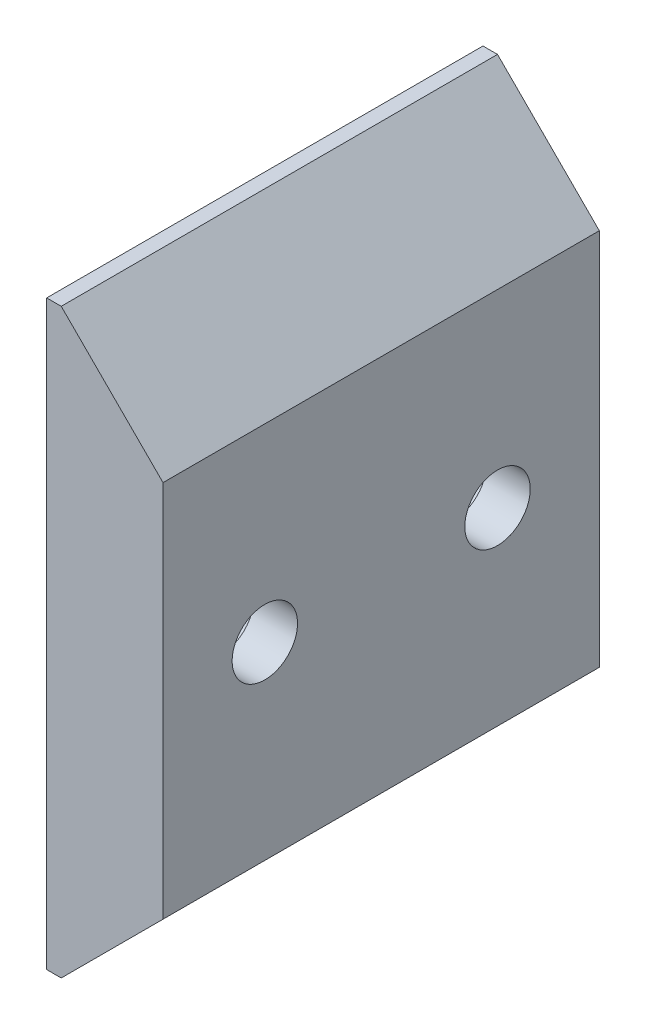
ISO-10303-21;
HEADER;
FILE_DESCRIPTION(('STEP AP214'),'2;1');
FILE_NAME('part.step','',(''),(''),'','','');
FILE_SCHEMA(('AUTOMOTIVE_DESIGN { 1 0 10303 214 1 1 1 1 }'));
ENDSEC;
DATA;
#1=APPLICATION_CONTEXT('core data for automotive mechanical design processes');
#2=APPLICATION_PROTOCOL_DEFINITION('international standard','automotive_design',2000,#1);
#3=PRODUCT_CONTEXT('',#1,'mechanical');
#4=PRODUCT('Part','Part','',(#3));
#5=PRODUCT_RELATED_PRODUCT_CATEGORY('part','',(#4));
#6=PRODUCT_DEFINITION_FORMATION('','',#4);
#7=PRODUCT_DEFINITION_CONTEXT('part definition',#1,'design');
#8=PRODUCT_DEFINITION('design','',#6,#7);
#9=PRODUCT_DEFINITION_SHAPE('','',#8);
#10=(LENGTH_UNIT() NAMED_UNIT(*) SI_UNIT(.MILLI.,.METRE.));
#11=(NAMED_UNIT(*) PLANE_ANGLE_UNIT() SI_UNIT($,.RADIAN.));
#12=(NAMED_UNIT(*) SI_UNIT($,.STERADIAN.) SOLID_ANGLE_UNIT());
#13=UNCERTAINTY_MEASURE_WITH_UNIT(LENGTH_MEASURE(1.E-05),#10,'distance_accuracy_value','');
#14=(GEOMETRIC_REPRESENTATION_CONTEXT(3) GLOBAL_UNCERTAINTY_ASSIGNED_CONTEXT((#13)) GLOBAL_UNIT_ASSIGNED_CONTEXT((#10,
#11,#12)) REPRESENTATION_CONTEXT('',''));
#15=CARTESIAN_POINT('',(0.,0.,0.));
#16=DIRECTION('',(0.,0.,1.));
#17=DIRECTION('',(1.,0.,0.));
#18=AXIS2_PLACEMENT_3D('',#15,#16,#17);
#19=CARTESIAN_POINT('',(0.,20.,15.));
#20=DIRECTION('',(0.,-1.,0.));
#21=DIRECTION('',(0.,0.,-1.));
#22=AXIS2_PLACEMENT_3D('',#19,#20,#21);
#23=PLANE('',#22);
#24=DIRECTION('',(-1.,0.,0.));
#25=VECTOR('',#24,1.);
#26=CARTESIAN_POINT('',(0.,20.,-15.));
#27=LINE('',#26,#25);
#28=CARTESIAN_POINT('',(1.,20.,-15.));
#29=VERTEX_POINT('',#28);
#30=CARTESIAN_POINT('',(0.,20.,-15.));
#31=VERTEX_POINT('',#30);
#32=EDGE_CURVE('E84',#29,#31,#27,.T.);
#33=ORIENTED_EDGE('',*,*,#32,.T.);
#34=DIRECTION('',(0.,0.,-1.));
#35=VECTOR('',#34,1.);
#36=CARTESIAN_POINT('',(0.,20.,15.));
#37=LINE('',#36,#35);
#38=CARTESIAN_POINT('',(0.,20.,15.));
#39=VERTEX_POINT('',#38);
#40=EDGE_CURVE('E11',#39,#31,#37,.T.);
#41=ORIENTED_EDGE('',*,*,#40,.F.);
#42=DIRECTION('',(-1.,0.,0.));
#43=VECTOR('',#42,1.);
#44=CARTESIAN_POINT('',(0.,20.,15.));
#45=LINE('',#44,#43);
#46=CARTESIAN_POINT('',(1.,20.,15.));
#47=VERTEX_POINT('',#46);
#48=EDGE_CURVE('E112',#47,#39,#45,.T.);
#49=ORIENTED_EDGE('',*,*,#48,.F.);
#50=DIRECTION('',(0.,0.,-1.));
#51=VECTOR('',#50,1.);
#52=CARTESIAN_POINT('',(1.,20.,15.));
#53=LINE('',#52,#51);
#54=EDGE_CURVE('E97',#47,#29,#53,.T.);
#55=ORIENTED_EDGE('',*,*,#54,.T.);
#56=EDGE_LOOP('',(#33,#41,#49,#55));
#57=FACE_BOUND('',#56,.T.);
#58=ADVANCED_FACE('F28',(#57),#23,.F.);
#59=CARTESIAN_POINT('',(0.,-20.,15.));
#60=DIRECTION('',(1.,0.,0.));
#61=DIRECTION('',(0.,0.,-1.));
#62=AXIS2_PLACEMENT_3D('',#59,#60,#61);
#63=PLANE('',#62);
#64=CARTESIAN_POINT('',(0.,0.,8.));
#65=DIRECTION('',(-1.,0.,0.));
#66=DIRECTION('',(0.,0.,1.));
#67=AXIS2_PLACEMENT_3D('',#64,#65,#66);
#68=CIRCLE('',#67,4.);
#69=CARTESIAN_POINT('',(0.,0.,12.));
#70=VERTEX_POINT('',#69);
#71=EDGE_CURVE('E268',#70,#70,#68,.T.);
#72=ORIENTED_EDGE('',*,*,#71,.F.);
#73=EDGE_LOOP('',(#72));
#74=FACE_BOUND('',#73,.T.);
#75=CARTESIAN_POINT('',(0.,0.,-8.));
#76=DIRECTION('',(-1.,0.,0.));
#77=DIRECTION('',(0.,0.,1.));
#78=AXIS2_PLACEMENT_3D('',#75,#76,#77);
#79=CIRCLE('',#78,4.);
#80=CARTESIAN_POINT('',(0.,0.,-4.));
#81=VERTEX_POINT('',#80);
#82=EDGE_CURVE('E98',#81,#81,#79,.T.);
#83=ORIENTED_EDGE('',*,*,#82,.F.);
#84=EDGE_LOOP('',(#83));
#85=FACE_BOUND('',#84,.T.);
#86=DIRECTION('',(0.,-1.,0.));
#87=VECTOR('',#86,1.);
#88=CARTESIAN_POINT('',(0.,-20.,-15.));
#89=LINE('',#88,#87);
#90=CARTESIAN_POINT('',(0.,-20.,-15.));
#91=VERTEX_POINT('',#90);
#92=EDGE_CURVE('E80',#31,#91,#89,.T.);
#93=ORIENTED_EDGE('',*,*,#92,.T.);
#94=DIRECTION('',(0.,0.,-1.));
#95=VECTOR('',#94,1.);
#96=CARTESIAN_POINT('',(0.,-20.,15.));
#97=LINE('',#96,#95);
#98=CARTESIAN_POINT('',(0.,-20.,15.));
#99=VERTEX_POINT('',#98);
#100=EDGE_CURVE('E35',#99,#91,#97,.T.);
#101=ORIENTED_EDGE('',*,*,#100,.F.);
#102=DIRECTION('',(0.,-1.,0.));
#103=VECTOR('',#102,1.);
#104=CARTESIAN_POINT('',(0.,-20.,15.));
#105=LINE('',#104,#103);
#106=EDGE_CURVE('E93',#39,#99,#105,.T.);
#107=ORIENTED_EDGE('',*,*,#106,.F.);
#108=ORIENTED_EDGE('',*,*,#40,.T.);
#109=EDGE_LOOP('',(#93,#101,#107,#108));
#110=FACE_BOUND('',#109,.T.);
#111=ADVANCED_FACE('F92',(#74,#85,#110),#63,.F.);
#112=CARTESIAN_POINT('',(0.,-20.,15.));
#113=DIRECTION('',(0.,1.,0.));
#114=DIRECTION('',(0.,0.,1.));
#115=AXIS2_PLACEMENT_3D('',#112,#113,#114);
#116=PLANE('',#115);
#117=DIRECTION('',(1.,0.,0.));
#118=VECTOR('',#117,1.);
#119=CARTESIAN_POINT('',(0.,-20.,-15.));
#120=LINE('',#119,#118);
#121=CARTESIAN_POINT('',(1.,-20.,-15.));
#122=VERTEX_POINT('',#121);
#123=EDGE_CURVE('E86',#91,#122,#120,.T.);
#124=ORIENTED_EDGE('',*,*,#123,.T.);
#125=DIRECTION('',(0.,0.,-1.));
#126=VECTOR('',#125,1.);
#127=CARTESIAN_POINT('',(1.,-20.,15.));
#128=LINE('',#127,#126);
#129=CARTESIAN_POINT('',(1.,-20.,15.));
#130=VERTEX_POINT('',#129);
#131=EDGE_CURVE('E128',#130,#122,#128,.T.);
#132=ORIENTED_EDGE('',*,*,#131,.F.);
#133=DIRECTION('',(1.,0.,0.));
#134=VECTOR('',#133,1.);
#135=CARTESIAN_POINT('',(0.,-20.,15.));
#136=LINE('',#135,#134);
#137=EDGE_CURVE('E115',#99,#130,#136,.T.);
#138=ORIENTED_EDGE('',*,*,#137,.F.);
#139=ORIENTED_EDGE('',*,*,#100,.T.);
#140=EDGE_LOOP('',(#124,#132,#138,#139));
#141=FACE_BOUND('',#140,.T.);
#142=ADVANCED_FACE('F132',(#141),#116,.F.);
#143=CARTESIAN_POINT('',(1.,-20.,15.));
#144=DIRECTION('',(-0.707106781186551,0.707106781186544,0.));
#145=DIRECTION('',(-0.707106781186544,-0.707106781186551,0.));
#146=AXIS2_PLACEMENT_3D('',#143,#144,#145);
#147=PLANE('',#146);
#148=DIRECTION('',(0.707106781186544,0.707106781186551,0.));
#149=VECTOR('',#148,1.);
#150=CARTESIAN_POINT('',(1.,-20.,-15.));
#151=LINE('',#150,#149);
#152=CARTESIAN_POINT('',(8.,-12.9999999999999,-15.));
#153=VERTEX_POINT('',#152);
#154=EDGE_CURVE('E106',#122,#153,#151,.T.);
#155=ORIENTED_EDGE('',*,*,#154,.T.);
#156=DIRECTION('',(0.,0.,-1.));
#157=VECTOR('',#156,1.);
#158=CARTESIAN_POINT('',(8.,-12.9999999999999,15.));
#159=LINE('',#158,#157);
#160=CARTESIAN_POINT('',(8.,-12.9999999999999,15.));
#161=VERTEX_POINT('',#160);
#162=EDGE_CURVE('E125',#161,#153,#159,.T.);
#163=ORIENTED_EDGE('',*,*,#162,.F.);
#164=DIRECTION('',(0.707106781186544,0.707106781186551,0.));
#165=VECTOR('',#164,1.);
#166=CARTESIAN_POINT('',(1.,-20.,15.));
#167=LINE('',#166,#165);
#168=EDGE_CURVE('E117',#130,#161,#167,.T.);
#169=ORIENTED_EDGE('',*,*,#168,.F.);
#170=ORIENTED_EDGE('',*,*,#131,.T.);
#171=EDGE_LOOP('',(#155,#163,#169,#170));
#172=FACE_BOUND('',#171,.T.);
#173=ADVANCED_FACE('F138',(#172),#147,.F.);
#174=CARTESIAN_POINT('',(8.,12.9999999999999,15.));
#175=DIRECTION('',(-1.,0.,0.));
#176=DIRECTION('',(0.,0.,1.));
#177=AXIS2_PLACEMENT_3D('',#174,#175,#176);
#178=PLANE('',#177);
#179=CARTESIAN_POINT('',(8.,0.,8.));
#180=DIRECTION('',(-1.,0.,0.));
#181=DIRECTION('',(0.,0.,1.));
#182=AXIS2_PLACEMENT_3D('',#179,#180,#181);
#183=CIRCLE('',#182,2.25);
#184=CARTESIAN_POINT('',(8.,0.,10.25));
#185=VERTEX_POINT('',#184);
#186=EDGE_CURVE('E261',#185,#185,#183,.T.);
#187=ORIENTED_EDGE('',*,*,#186,.T.);
#188=EDGE_LOOP('',(#187));
#189=FACE_BOUND('',#188,.T.);
#190=CARTESIAN_POINT('',(8.,0.,-8.));
#191=DIRECTION('',(-1.,0.,0.));
#192=DIRECTION('',(0.,0.,1.));
#193=AXIS2_PLACEMENT_3D('',#190,#191,#192);
#194=CIRCLE('',#193,2.25);
#195=CARTESIAN_POINT('',(8.,0.,-5.75));
#196=VERTEX_POINT('',#195);
#197=EDGE_CURVE('E274',#196,#196,#194,.T.);
#198=ORIENTED_EDGE('',*,*,#197,.T.);
#199=EDGE_LOOP('',(#198));
#200=FACE_BOUND('',#199,.T.);
#201=DIRECTION('',(0.,1.,0.));
#202=VECTOR('',#201,1.);
#203=CARTESIAN_POINT('',(8.,12.9999999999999,-15.));
#204=LINE('',#203,#202);
#205=CARTESIAN_POINT('',(8.,12.9999999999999,-15.));
#206=VERTEX_POINT('',#205);
#207=EDGE_CURVE('E108',#153,#206,#204,.T.);
#208=ORIENTED_EDGE('',*,*,#207,.T.);
#209=DIRECTION('',(0.,0.,-1.));
#210=VECTOR('',#209,1.);
#211=CARTESIAN_POINT('',(8.,12.9999999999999,15.));
#212=LINE('',#211,#210);
#213=CARTESIAN_POINT('',(8.,12.9999999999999,15.));
#214=VERTEX_POINT('',#213);
#215=EDGE_CURVE('E122',#214,#206,#212,.T.);
#216=ORIENTED_EDGE('',*,*,#215,.F.);
#217=DIRECTION('',(0.,1.,0.));
#218=VECTOR('',#217,1.);
#219=CARTESIAN_POINT('',(8.,12.9999999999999,15.));
#220=LINE('',#219,#218);
#221=EDGE_CURVE('E47',#161,#214,#220,.T.);
#222=ORIENTED_EDGE('',*,*,#221,.F.);
#223=ORIENTED_EDGE('',*,*,#162,.T.);
#224=EDGE_LOOP('',(#208,#216,#222,#223));
#225=FACE_BOUND('',#224,.T.);
#226=ADVANCED_FACE('F141',(#189,#200,#225),#178,.F.);
#227=CARTESIAN_POINT('',(1.,20.,15.));
#228=DIRECTION('',(-0.707106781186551,-0.707106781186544,0.));
#229=DIRECTION('',(0.707106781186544,-0.707106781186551,0.));
#230=AXIS2_PLACEMENT_3D('',#227,#228,#229);
#231=PLANE('',#230);
#232=DIRECTION('',(-0.707106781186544,0.707106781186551,0.));
#233=VECTOR('',#232,1.);
#234=CARTESIAN_POINT('',(1.,20.,-15.));
#235=LINE('',#234,#233);
#236=EDGE_CURVE('E110',#206,#29,#235,.T.);
#237=ORIENTED_EDGE('',*,*,#236,.T.);
#238=ORIENTED_EDGE('',*,*,#54,.F.);
#239=DIRECTION('',(-0.707106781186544,0.707106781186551,0.));
#240=VECTOR('',#239,1.);
#241=CARTESIAN_POINT('',(1.,20.,15.));
#242=LINE('',#241,#240);
#243=EDGE_CURVE('E42',#214,#47,#242,.T.);
#244=ORIENTED_EDGE('',*,*,#243,.F.);
#245=ORIENTED_EDGE('',*,*,#215,.T.);
#246=EDGE_LOOP('',(#237,#238,#244,#245));
#247=FACE_BOUND('',#246,.T.);
#248=ADVANCED_FACE('F143',(#247),#231,.F.);
#249=CARTESIAN_POINT('',(8.,20.,15.));
#250=DIRECTION('',(0.,0.,-1.));
#251=DIRECTION('',(-1.,0.,0.));
#252=AXIS2_PLACEMENT_3D('',#249,#250,#251);
#253=PLANE('',#252);
#254=ORIENTED_EDGE('',*,*,#48,.T.);
#255=ORIENTED_EDGE('',*,*,#106,.T.);
#256=ORIENTED_EDGE('',*,*,#137,.T.);
#257=ORIENTED_EDGE('',*,*,#168,.T.);
#258=ORIENTED_EDGE('',*,*,#221,.T.);
#259=ORIENTED_EDGE('',*,*,#243,.T.);
#260=EDGE_LOOP('',(#254,#255,#256,#257,#258,#259));
#261=FACE_BOUND('',#260,.T.);
#262=ADVANCED_FACE('F135',(#261),#253,.F.);
#263=CARTESIAN_POINT('',(8.,20.,-15.));
#264=DIRECTION('',(0.,0.,-1.));
#265=DIRECTION('',(-1.,0.,0.));
#266=AXIS2_PLACEMENT_3D('',#263,#264,#265);
#267=PLANE('',#266);
#268=ORIENTED_EDGE('',*,*,#32,.F.);
#269=ORIENTED_EDGE('',*,*,#236,.F.);
#270=ORIENTED_EDGE('',*,*,#207,.F.);
#271=ORIENTED_EDGE('',*,*,#154,.F.);
#272=ORIENTED_EDGE('',*,*,#123,.F.);
#273=ORIENTED_EDGE('',*,*,#92,.F.);
#274=EDGE_LOOP('',(#268,#269,#270,#271,#272,#273));
#275=FACE_BOUND('',#274,.T.);
#276=ADVANCED_FACE('F81',(#275),#267,.T.);
#277=CARTESIAN_POINT('',(0.,0.,-8.));
#278=DIRECTION('',(-1.,0.,0.));
#279=DIRECTION('',(0.,0.,1.));
#280=AXIS2_PLACEMENT_3D('',#277,#278,#279);
#281=CYLINDRICAL_SURFACE('',#280,4.);
#282=CARTESIAN_POINT('',(5.,0.,-8.));
#283=DIRECTION('',(-1.,0.,0.));
#284=DIRECTION('',(0.,0.,1.));
#285=AXIS2_PLACEMENT_3D('',#282,#283,#284);
#286=CIRCLE('',#285,4.);
#287=CARTESIAN_POINT('',(5.,0.,-4.));
#288=VERTEX_POINT('',#287);
#289=EDGE_CURVE('E101',#288,#288,#286,.T.);
#290=ORIENTED_EDGE('',*,*,#289,.F.);
#291=EDGE_LOOP('',(#290));
#292=FACE_BOUND('',#291,.T.);
#293=ORIENTED_EDGE('',*,*,#82,.T.);
#294=EDGE_LOOP('',(#293));
#295=FACE_BOUND('',#294,.T.);
#296=ADVANCED_FACE('F183',(#292,#295),#281,.F.);
#297=CARTESIAN_POINT('',(5.,2.25,-8.));
#298=DIRECTION('',(1.,0.,0.));
#299=DIRECTION('',(0.,0.,-1.));
#300=AXIS2_PLACEMENT_3D('',#297,#298,#299);
#301=PLANE('',#300);
#302=CARTESIAN_POINT('',(5.,0.,-8.));
#303=DIRECTION('',(-1.,0.,0.));
#304=DIRECTION('',(0.,0.,1.));
#305=AXIS2_PLACEMENT_3D('',#302,#303,#304);
#306=CIRCLE('',#305,2.25);
#307=CARTESIAN_POINT('',(5.,0.,-5.75));
#308=VERTEX_POINT('',#307);
#309=EDGE_CURVE('E277',#308,#308,#306,.T.);
#310=ORIENTED_EDGE('',*,*,#309,.F.);
#311=EDGE_LOOP('',(#310));
#312=FACE_BOUND('',#311,.T.);
#313=ORIENTED_EDGE('',*,*,#289,.T.);
#314=EDGE_LOOP('',(#313));
#315=FACE_BOUND('',#314,.T.);
#316=ADVANCED_FACE('F188',(#312,#315),#301,.F.);
#317=CARTESIAN_POINT('',(0.,0.,-8.));
#318=DIRECTION('',(-1.,0.,0.));
#319=DIRECTION('',(0.,0.,1.));
#320=AXIS2_PLACEMENT_3D('',#317,#318,#319);
#321=CYLINDRICAL_SURFACE('',#320,2.25);
#322=ORIENTED_EDGE('',*,*,#197,.F.);
#323=EDGE_LOOP('',(#322));
#324=FACE_BOUND('',#323,.T.);
#325=ORIENTED_EDGE('',*,*,#309,.T.);
#326=EDGE_LOOP('',(#325));
#327=FACE_BOUND('',#326,.T.);
#328=ADVANCED_FACE('F200',(#324,#327),#321,.F.);
#329=CARTESIAN_POINT('',(0.,0.,8.));
#330=DIRECTION('',(-1.,0.,0.));
#331=DIRECTION('',(0.,0.,1.));
#332=AXIS2_PLACEMENT_3D('',#329,#330,#331);
#333=CYLINDRICAL_SURFACE('',#332,4.);
#334=CARTESIAN_POINT('',(5.,0.,8.));
#335=DIRECTION('',(-1.,0.,0.));
#336=DIRECTION('',(0.,0.,1.));
#337=AXIS2_PLACEMENT_3D('',#334,#335,#336);
#338=CIRCLE('',#337,4.);
#339=CARTESIAN_POINT('',(5.,0.,12.));
#340=VERTEX_POINT('',#339);
#341=EDGE_CURVE('E265',#340,#340,#338,.T.);
#342=ORIENTED_EDGE('',*,*,#341,.F.);
#343=EDGE_LOOP('',(#342));
#344=FACE_BOUND('',#343,.T.);
#345=ORIENTED_EDGE('',*,*,#71,.T.);
#346=EDGE_LOOP('',(#345));
#347=FACE_BOUND('',#346,.T.);
#348=ADVANCED_FACE('F210',(#344,#347),#333,.F.);
#349=CARTESIAN_POINT('',(5.,2.25,8.));
#350=DIRECTION('',(1.,0.,0.));
#351=DIRECTION('',(0.,0.,-1.));
#352=AXIS2_PLACEMENT_3D('',#349,#350,#351);
#353=PLANE('',#352);
#354=CARTESIAN_POINT('',(5.,0.,8.));
#355=DIRECTION('',(-1.,0.,0.));
#356=DIRECTION('',(0.,0.,1.));
#357=AXIS2_PLACEMENT_3D('',#354,#355,#356);
#358=CIRCLE('',#357,2.25);
#359=CARTESIAN_POINT('',(5.,0.,10.25));
#360=VERTEX_POINT('',#359);
#361=EDGE_CURVE('E264',#360,#360,#358,.T.);
#362=ORIENTED_EDGE('',*,*,#361,.F.);
#363=EDGE_LOOP('',(#362));
#364=FACE_BOUND('',#363,.T.);
#365=ORIENTED_EDGE('',*,*,#341,.T.);
#366=EDGE_LOOP('',(#365));
#367=FACE_BOUND('',#366,.T.);
#368=ADVANCED_FACE('F220',(#364,#367),#353,.F.);
#369=CARTESIAN_POINT('',(0.,0.,8.));
#370=DIRECTION('',(-1.,0.,0.));
#371=DIRECTION('',(0.,0.,1.));
#372=AXIS2_PLACEMENT_3D('',#369,#370,#371);
#373=CYLINDRICAL_SURFACE('',#372,2.25);
#374=ORIENTED_EDGE('',*,*,#186,.F.);
#375=EDGE_LOOP('',(#374));
#376=FACE_BOUND('',#375,.T.);
#377=ORIENTED_EDGE('',*,*,#361,.T.);
#378=EDGE_LOOP('',(#377));
#379=FACE_BOUND('',#378,.T.);
#380=ADVANCED_FACE('F230',(#376,#379),#373,.F.);
#381=CLOSED_SHELL('',(#58,#111,#142,#173,#226,#248,#262,#276,#296,#316,#328,#348,#368,#380));
#382=MANIFOLD_SOLID_BREP('B2',#381);
#383=ADVANCED_BREP_SHAPE_REPRESENTATION('',(#18,#382),#14);
#384=SHAPE_DEFINITION_REPRESENTATION(#9,#383);
ENDSEC;
END-ISO-10303-21;
